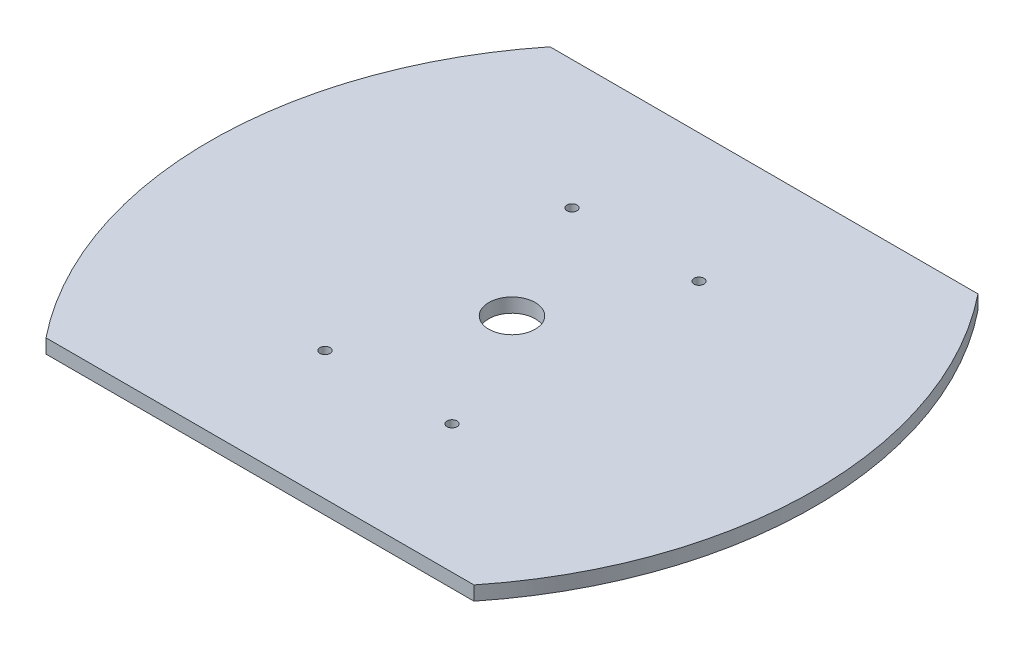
from build123d import *

# Parameters (mm, degrees)
BOSS_EXTRUDE1_DEPTH = 3.5
SKETCH2_R           = 11.5
CUT_EXTRUDE1_DEPTH  = 5
SKETCH3_R           = 2.5
CUT_EXTRUDE2_DEPTH  = 10


with BuildPart() as part:
    # Sketch1 → Boss-Extrude1 (new, symmetric)
    with BuildSketch(Plane(origin=(0, 0, 0), x_dir=(1, 0, 0), z_dir=(0, 1, 0))):
        with BuildLine():
            Line((-106.12494996, 125), (106.12494996, 125))
            ThreePointArc((106.12494996, 125), (150, 0), (106.12494996, -125))
            Line((106.12494996, -125), (-106.12494996, -125))
            ThreePointArc((-106.12494996, -125), (-150, 0), (-106.12494996, 125))
        make_face()
    extrude(amount=BOSS_EXTRUDE1_DEPTH, both=True)

    # Sketch2 → Cut-Extrude1 (cut, symmetric)
    with BuildSketch(Plane(origin=(0, 0, 0), x_dir=(1, 0, 0), z_dir=(0, 1, 0))):
        with Locations(Location((0, 0, 0), (0, 0, 90))):
            Circle(SKETCH2_R)
    extrude(amount=CUT_EXTRUDE1_DEPTH, both=True, mode=Mode.SUBTRACT)

    # Sketch3 → Cut-Extrude2 (cut)
    with BuildSketch(Plane(origin=(0, 3.5, 0), x_dir=(1, 0, 0), z_dir=(0, 1, 0))):
        with Locations(Location((-31.5, 61.25, 0), (0, 0, 270))):
            Circle(SKETCH3_R)
        with Locations(Location((31.5, 61.25, 0), (0, 0, 270))):
            Circle(SKETCH3_R)
        with Locations(Location((31.5, -61.25, 0), (0, 0, 270))):
            Circle(SKETCH3_R)
        with Locations(Location((-31.5, -61.25, 0), (0, 0, 270))):
            Circle(SKETCH3_R)
    extrude(amount=-CUT_EXTRUDE2_DEPTH, mode=Mode.SUBTRACT)


solid = part.part
